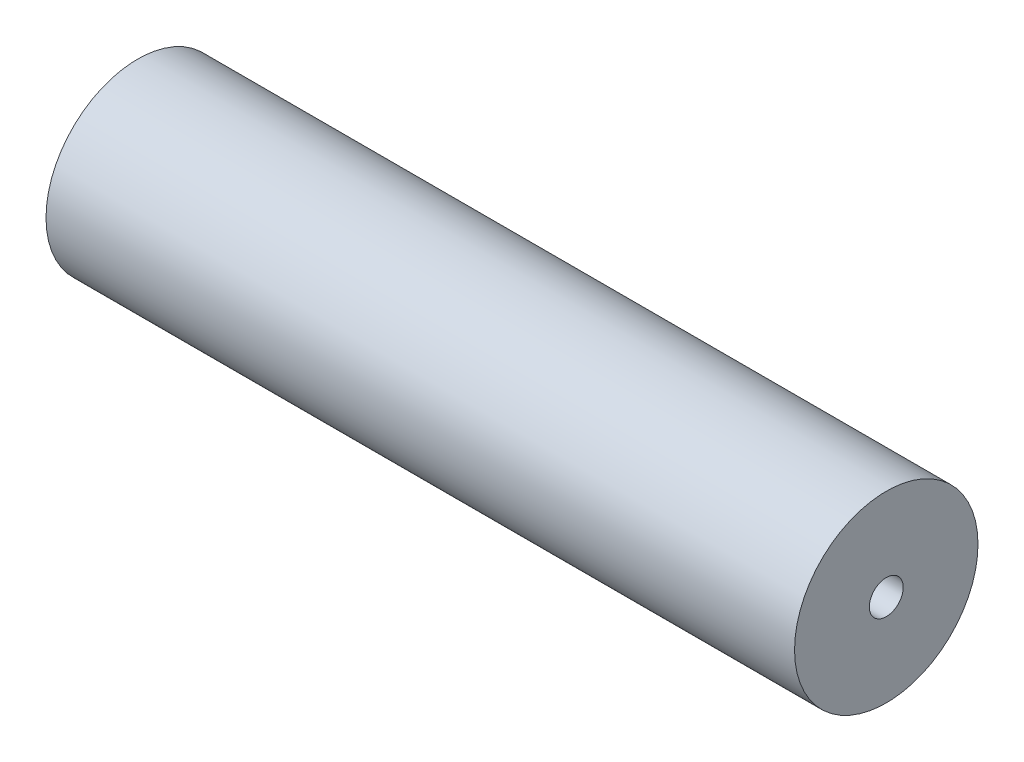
ISO-10303-21;
HEADER;
FILE_DESCRIPTION(('STEP AP214'),'2;1');
FILE_NAME('part.step','',(''),(''),'','','');
FILE_SCHEMA(('AUTOMOTIVE_DESIGN { 1 0 10303 214 1 1 1 1 }'));
ENDSEC;
DATA;
#1=APPLICATION_CONTEXT('core data for automotive mechanical design processes');
#2=APPLICATION_PROTOCOL_DEFINITION('international standard','automotive_design',2000,#1);
#3=PRODUCT_CONTEXT('',#1,'mechanical');
#4=PRODUCT('Part','Part','',(#3));
#5=PRODUCT_RELATED_PRODUCT_CATEGORY('part','',(#4));
#6=PRODUCT_DEFINITION_FORMATION('','',#4);
#7=PRODUCT_DEFINITION_CONTEXT('part definition',#1,'design');
#8=PRODUCT_DEFINITION('design','',#6,#7);
#9=PRODUCT_DEFINITION_SHAPE('','',#8);
#10=(LENGTH_UNIT() NAMED_UNIT(*) SI_UNIT(.MILLI.,.METRE.));
#11=(NAMED_UNIT(*) PLANE_ANGLE_UNIT() SI_UNIT($,.RADIAN.));
#12=(NAMED_UNIT(*) SI_UNIT($,.STERADIAN.) SOLID_ANGLE_UNIT());
#13=UNCERTAINTY_MEASURE_WITH_UNIT(LENGTH_MEASURE(1.E-05),#10,'distance_accuracy_value','');
#14=(GEOMETRIC_REPRESENTATION_CONTEXT(3) GLOBAL_UNCERTAINTY_ASSIGNED_CONTEXT((#13)) GLOBAL_UNIT_ASSIGNED_CONTEXT((#10,
#11,#12)) REPRESENTATION_CONTEXT('',''));
#15=CARTESIAN_POINT('',(0.,0.,0.));
#16=DIRECTION('',(0.,0.,1.));
#17=DIRECTION('',(1.,0.,0.));
#18=AXIS2_PLACEMENT_3D('',#15,#16,#17);
#19=CARTESIAN_POINT('',(0.,0.,0.));
#20=DIRECTION('',(1.,0.,0.));
#21=DIRECTION('',(0.,0.,-1.));
#22=AXIS2_PLACEMENT_3D('',#19,#20,#21);
#23=PLANE('',#22);
#24=CARTESIAN_POINT('',(0.,0.,0.));
#25=DIRECTION('',(-1.,0.,0.));
#26=DIRECTION('',(0.,0.,1.));
#27=AXIS2_PLACEMENT_3D('',#24,#25,#26);
#28=CIRCLE('',#27,35.052);
#29=CARTESIAN_POINT('',(0.,0.,35.052));
#30=VERTEX_POINT('',#29);
#31=EDGE_CURVE('E392',#30,#30,#28,.T.);
#32=ORIENTED_EDGE('',*,*,#31,.F.);
#33=EDGE_LOOP('',(#32));
#34=FACE_BOUND('',#33,.T.);
#35=CARTESIAN_POINT('',(0.,0.,0.));
#36=DIRECTION('',(1.,0.,0.));
#37=DIRECTION('',(0.,0.,-1.));
#38=AXIS2_PLACEMENT_3D('',#35,#36,#37);
#39=CIRCLE('',#38,189.865);
#40=CARTESIAN_POINT('',(0.,0.,-189.865));
#41=VERTEX_POINT('',#40);
#42=EDGE_CURVE('E10',#41,#41,#39,.T.);
#43=ORIENTED_EDGE('',*,*,#42,.F.);
#44=EDGE_LOOP('',(#43));
#45=FACE_BOUND('',#44,.T.);
#46=ADVANCED_FACE('F378',(#34,#45),#23,.F.);
#47=CARTESIAN_POINT('',(0.,0.,0.));
#48=DIRECTION('',(1.,0.,0.));
#49=DIRECTION('',(0.,0.,-1.));
#50=AXIS2_PLACEMENT_3D('',#47,#48,#49);
#51=CYLINDRICAL_SURFACE('',#50,189.865);
#52=CARTESIAN_POINT('',(1549.4,0.,0.));
#53=DIRECTION('',(1.,0.,0.));
#54=DIRECTION('',(0.,0.,-1.));
#55=AXIS2_PLACEMENT_3D('',#52,#53,#54);
#56=CIRCLE('',#55,189.865);
#57=CARTESIAN_POINT('',(1549.4,0.,-189.865));
#58=VERTEX_POINT('',#57);
#59=EDGE_CURVE('E384',#58,#58,#56,.T.);
#60=ORIENTED_EDGE('',*,*,#59,.F.);
#61=EDGE_LOOP('',(#60));
#62=FACE_BOUND('',#61,.T.);
#63=ORIENTED_EDGE('',*,*,#42,.T.);
#64=EDGE_LOOP('',(#63));
#65=FACE_BOUND('',#64,.T.);
#66=ADVANCED_FACE('F402',(#62,#65),#51,.T.);
#67=CARTESIAN_POINT('',(1549.4,0.,0.));
#68=DIRECTION('',(-1.,0.,0.));
#69=DIRECTION('',(0.,0.,1.));
#70=AXIS2_PLACEMENT_3D('',#67,#68,#69);
#71=PLANE('',#70);
#72=CARTESIAN_POINT('',(1549.4,0.,0.));
#73=DIRECTION('',(-1.,0.,0.));
#74=DIRECTION('',(0.,0.,1.));
#75=AXIS2_PLACEMENT_3D('',#72,#73,#74);
#76=CIRCLE('',#75,35.052);
#77=CARTESIAN_POINT('',(1549.4,0.,35.052));
#78=VERTEX_POINT('',#77);
#79=EDGE_CURVE('E388',#78,#78,#76,.T.);
#80=ORIENTED_EDGE('',*,*,#79,.T.);
#81=EDGE_LOOP('',(#80));
#82=FACE_BOUND('',#81,.T.);
#83=ORIENTED_EDGE('',*,*,#59,.T.);
#84=EDGE_LOOP('',(#83));
#85=FACE_BOUND('',#84,.T.);
#86=ADVANCED_FACE('F407',(#82,#85),#71,.F.);
#87=CARTESIAN_POINT('',(1549.4,0.,0.));
#88=DIRECTION('',(-1.,0.,0.));
#89=DIRECTION('',(0.,0.,1.));
#90=AXIS2_PLACEMENT_3D('',#87,#88,#89);
#91=CYLINDRICAL_SURFACE('',#90,35.052);
#92=ORIENTED_EDGE('',*,*,#79,.F.);
#93=EDGE_LOOP('',(#92));
#94=FACE_BOUND('',#93,.T.);
#95=ORIENTED_EDGE('',*,*,#31,.T.);
#96=EDGE_LOOP('',(#95));
#97=FACE_BOUND('',#96,.T.);
#98=ADVANCED_FACE('F398',(#94,#97),#91,.F.);
#99=CLOSED_SHELL('',(#46,#66,#86,#98));
#100=MANIFOLD_SOLID_BREP('B2',#99);
#101=ADVANCED_BREP_SHAPE_REPRESENTATION('',(#18,#100),#14);
#102=SHAPE_DEFINITION_REPRESENTATION(#9,#101);
ENDSEC;
END-ISO-10303-21;
